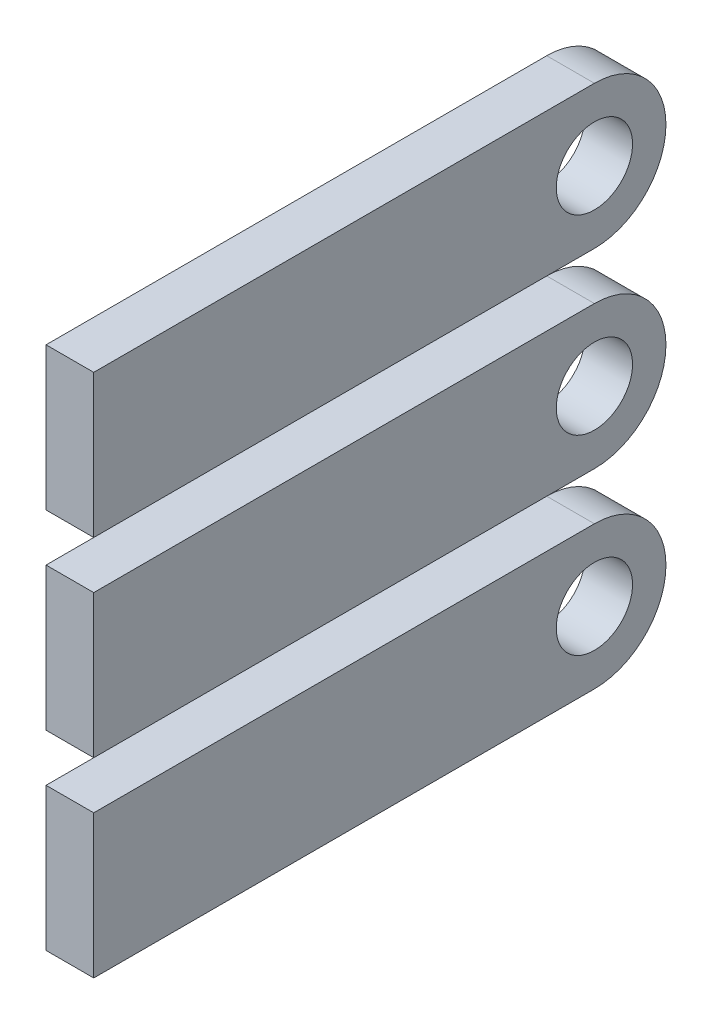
ISO-10303-21;
HEADER;
FILE_DESCRIPTION(('STEP AP214'),'2;1');
FILE_NAME('part.step','',(''),(''),'','','');
FILE_SCHEMA(('AUTOMOTIVE_DESIGN { 1 0 10303 214 1 1 1 1 }'));
ENDSEC;
DATA;
#1=APPLICATION_CONTEXT('core data for automotive mechanical design processes');
#2=APPLICATION_PROTOCOL_DEFINITION('international standard','automotive_design',2000,#1);
#3=PRODUCT_CONTEXT('',#1,'mechanical');
#4=PRODUCT('Part','Part','',(#3));
#5=PRODUCT_RELATED_PRODUCT_CATEGORY('part','',(#4));
#6=PRODUCT_DEFINITION_FORMATION('','',#4);
#7=PRODUCT_DEFINITION_CONTEXT('part definition',#1,'design');
#8=PRODUCT_DEFINITION('design','',#6,#7);
#9=PRODUCT_DEFINITION_SHAPE('','',#8);
#10=(LENGTH_UNIT() NAMED_UNIT(*) SI_UNIT(.MILLI.,.METRE.));
#11=(NAMED_UNIT(*) PLANE_ANGLE_UNIT() SI_UNIT($,.RADIAN.));
#12=(NAMED_UNIT(*) SI_UNIT($,.STERADIAN.) SOLID_ANGLE_UNIT());
#13=UNCERTAINTY_MEASURE_WITH_UNIT(LENGTH_MEASURE(1.E-05),#10,'distance_accuracy_value','');
#14=(GEOMETRIC_REPRESENTATION_CONTEXT(3) GLOBAL_UNCERTAINTY_ASSIGNED_CONTEXT((#13)) GLOBAL_UNIT_ASSIGNED_CONTEXT((#10,
#11,#12)) REPRESENTATION_CONTEXT('',''));
#15=CARTESIAN_POINT('',(0.,0.,0.));
#16=DIRECTION('',(0.,0.,1.));
#17=DIRECTION('',(1.,0.,0.));
#18=AXIS2_PLACEMENT_3D('',#15,#16,#17);
#19=CARTESIAN_POINT('',(63.2075,18.0108777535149,-52.4));
#20=DIRECTION('',(-1.,0.,0.));
#21=DIRECTION('',(0.,-1.,0.));
#22=AXIS2_PLACEMENT_3D('',#19,#20,#21);
#23=PLANE('',#22);
#24=CARTESIAN_POINT('',(63.2075,13.0983777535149,-47.4875));
#25=DIRECTION('',(-1.,0.,0.));
#26=DIRECTION('',(0.,-1.,0.));
#27=AXIS2_PLACEMENT_3D('',#24,#25,#26);
#28=CIRCLE('',#27,2.62);
#29=CARTESIAN_POINT('',(63.2075,10.4783777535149,-47.4875));
#30=VERTEX_POINT('',#29);
#31=EDGE_CURVE('E915',#30,#30,#28,.T.);
#32=ORIENTED_EDGE('',*,*,#31,.T.);
#33=EDGE_LOOP('',(#32));
#34=FACE_BOUND('',#33,.T.);
#35=DIRECTION('',(0.,0.,1.));
#36=VECTOR('',#35,1.);
#37=CARTESIAN_POINT('',(63.2075,8.18587775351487,-52.4));
#38=LINE('',#37,#36);
#39=CARTESIAN_POINT('',(63.2075,8.18587775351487,-47.4875));
#40=VERTEX_POINT('',#39);
#41=CARTESIAN_POINT('',(63.2075,8.18587775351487,-13.1));
#42=VERTEX_POINT('',#41);
#43=EDGE_CURVE('E902',#40,#42,#38,.T.);
#44=ORIENTED_EDGE('',*,*,#43,.F.);
#45=CARTESIAN_POINT('',(63.2075,13.0983777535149,-47.4875));
#46=DIRECTION('',(-1.,0.,0.));
#47=DIRECTION('',(0.,-1.,0.));
#48=AXIS2_PLACEMENT_3D('',#45,#46,#47);
#49=CIRCLE('',#48,4.9125);
#50=CARTESIAN_POINT('',(63.2075,18.0108777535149,-47.4875));
#51=VERTEX_POINT('',#50);
#52=EDGE_CURVE('E890',#51,#40,#49,.T.);
#53=ORIENTED_EDGE('',*,*,#52,.F.);
#54=DIRECTION('',(0.,0.,1.));
#55=VECTOR('',#54,1.);
#56=CARTESIAN_POINT('',(63.2075,18.0108777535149,-52.4));
#57=LINE('',#56,#55);
#58=CARTESIAN_POINT('',(63.2075,18.0108777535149,-13.1));
#59=VERTEX_POINT('',#58);
#60=EDGE_CURVE('E911',#51,#59,#57,.T.);
#61=ORIENTED_EDGE('',*,*,#60,.T.);
#62=DIRECTION('',(0.,-1.,0.));
#63=VECTOR('',#62,1.);
#64=CARTESIAN_POINT('',(63.2075,18.0108777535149,-13.1));
#65=LINE('',#64,#63);
#66=EDGE_CURVE('E880',#59,#42,#65,.T.);
#67=ORIENTED_EDGE('',*,*,#66,.T.);
#68=EDGE_LOOP('',(#44,#53,#61,#67));
#69=FACE_BOUND('',#68,.T.);
#70=ADVANCED_FACE('F845',(#34,#69),#23,.F.);
#71=CARTESIAN_POINT('',(59.9325,18.0108777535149,-52.4));
#72=DIRECTION('',(1.,0.,0.));
#73=DIRECTION('',(0.,0.,-1.));
#74=AXIS2_PLACEMENT_3D('',#71,#72,#73);
#75=PLANE('',#74);
#76=CARTESIAN_POINT('',(59.9325,13.0983777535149,-47.4875));
#77=DIRECTION('',(-1.,0.,0.));
#78=DIRECTION('',(0.,0.,1.));
#79=AXIS2_PLACEMENT_3D('',#76,#77,#78);
#80=CIRCLE('',#79,2.62);
#81=CARTESIAN_POINT('',(59.9325,13.0983777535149,-44.8675));
#82=VERTEX_POINT('',#81);
#83=EDGE_CURVE('E13',#82,#82,#80,.T.);
#84=ORIENTED_EDGE('',*,*,#83,.F.);
#85=EDGE_LOOP('',(#84));
#86=FACE_BOUND('',#85,.T.);
#87=CARTESIAN_POINT('',(59.9325,13.0983777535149,-47.4875));
#88=DIRECTION('',(-1.,0.,0.));
#89=DIRECTION('',(0.,0.,1.));
#90=AXIS2_PLACEMENT_3D('',#87,#88,#89);
#91=CIRCLE('',#90,4.9125);
#92=CARTESIAN_POINT('',(59.9325,18.0108777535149,-47.4875));
#93=VERTEX_POINT('',#92);
#94=CARTESIAN_POINT('',(59.9325,8.18587775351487,-47.4875));
#95=VERTEX_POINT('',#94);
#96=EDGE_CURVE('E905',#93,#95,#91,.T.);
#97=ORIENTED_EDGE('',*,*,#96,.T.);
#98=DIRECTION('',(0.,0.,1.));
#99=VECTOR('',#98,1.);
#100=CARTESIAN_POINT('',(59.9325,8.18587775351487,-52.4));
#101=LINE('',#100,#99);
#102=CARTESIAN_POINT('',(59.9325,8.18587775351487,-13.1));
#103=VERTEX_POINT('',#102);
#104=EDGE_CURVE('E901',#95,#103,#101,.T.);
#105=ORIENTED_EDGE('',*,*,#104,.T.);
#106=DIRECTION('',(0.,1.,0.));
#107=VECTOR('',#106,1.);
#108=CARTESIAN_POINT('',(59.9325,18.0108777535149,-13.1));
#109=LINE('',#108,#107);
#110=CARTESIAN_POINT('',(59.9325,18.0108777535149,-13.1));
#111=VERTEX_POINT('',#110);
#112=EDGE_CURVE('E886',#103,#111,#109,.T.);
#113=ORIENTED_EDGE('',*,*,#112,.T.);
#114=DIRECTION('',(0.,0.,1.));
#115=VECTOR('',#114,1.);
#116=CARTESIAN_POINT('',(59.9325,18.0108777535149,-52.4));
#117=LINE('',#116,#115);
#118=EDGE_CURVE('E891',#93,#111,#117,.T.);
#119=ORIENTED_EDGE('',*,*,#118,.F.);
#120=EDGE_LOOP('',(#97,#105,#113,#119));
#121=FACE_BOUND('',#120,.T.);
#122=ADVANCED_FACE('F899',(#86,#121),#75,.F.);
#123=CARTESIAN_POINT('',(63.2075,8.18587775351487,-52.4));
#124=DIRECTION('',(0.,1.,0.));
#125=DIRECTION('',(0.,0.,1.));
#126=AXIS2_PLACEMENT_3D('',#123,#124,#125);
#127=PLANE('',#126);
#128=DIRECTION('',(-1.,0.,0.));
#129=VECTOR('',#128,1.);
#130=CARTESIAN_POINT('',(112.3325,8.18587775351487,-47.4875));
#131=LINE('',#130,#129);
#132=EDGE_CURVE('E849',#40,#95,#131,.T.);
#133=ORIENTED_EDGE('',*,*,#132,.F.);
#134=ORIENTED_EDGE('',*,*,#43,.T.);
#135=DIRECTION('',(-1.,0.,0.));
#136=VECTOR('',#135,1.);
#137=CARTESIAN_POINT('',(63.2075,8.18587775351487,-13.1));
#138=LINE('',#137,#136);
#139=EDGE_CURVE('E862',#42,#103,#138,.T.);
#140=ORIENTED_EDGE('',*,*,#139,.T.);
#141=ORIENTED_EDGE('',*,*,#104,.F.);
#142=EDGE_LOOP('',(#133,#134,#140,#141));
#143=FACE_BOUND('',#142,.T.);
#144=ADVANCED_FACE('F927',(#143),#127,.F.);
#145=CARTESIAN_POINT('',(63.2075,18.0108777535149,-52.4));
#146=DIRECTION('',(0.,-1.,0.));
#147=DIRECTION('',(1.,0.,0.));
#148=AXIS2_PLACEMENT_3D('',#145,#146,#147);
#149=PLANE('',#148);
#150=ORIENTED_EDGE('',*,*,#60,.F.);
#151=DIRECTION('',(-1.,0.,0.));
#152=VECTOR('',#151,1.);
#153=CARTESIAN_POINT('',(112.3325,18.0108777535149,-47.4875));
#154=LINE('',#153,#152);
#155=EDGE_CURVE('E896',#51,#93,#154,.T.);
#156=ORIENTED_EDGE('',*,*,#155,.T.);
#157=ORIENTED_EDGE('',*,*,#118,.T.);
#158=DIRECTION('',(1.,0.,0.));
#159=VECTOR('',#158,1.);
#160=CARTESIAN_POINT('',(63.2075,18.0108777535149,-13.1));
#161=LINE('',#160,#159);
#162=EDGE_CURVE('E883',#111,#59,#161,.T.);
#163=ORIENTED_EDGE('',*,*,#162,.T.);
#164=EDGE_LOOP('',(#150,#156,#157,#163));
#165=FACE_BOUND('',#164,.T.);
#166=ADVANCED_FACE('F895',(#165),#149,.F.);
#167=CARTESIAN_POINT('',(112.3325,13.0983777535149,-47.4875));
#168=DIRECTION('',(-1.,0.,0.));
#169=DIRECTION('',(0.,0.,1.));
#170=AXIS2_PLACEMENT_3D('',#167,#168,#169);
#171=CYLINDRICAL_SURFACE('',#170,4.9125);
#172=ORIENTED_EDGE('',*,*,#52,.T.);
#173=ORIENTED_EDGE('',*,*,#132,.T.);
#174=ORIENTED_EDGE('',*,*,#96,.F.);
#175=ORIENTED_EDGE('',*,*,#155,.F.);
#176=EDGE_LOOP('',(#172,#173,#174,#175));
#177=FACE_BOUND('',#176,.T.);
#178=ADVANCED_FACE('F925',(#177),#171,.T.);
#179=CARTESIAN_POINT('',(112.3325,13.0983777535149,-47.4875));
#180=DIRECTION('',(-1.,0.,0.));
#181=DIRECTION('',(0.,0.,1.));
#182=AXIS2_PLACEMENT_3D('',#179,#180,#181);
#183=CYLINDRICAL_SURFACE('',#182,2.62);
#184=ORIENTED_EDGE('',*,*,#83,.T.);
#185=EDGE_LOOP('',(#184));
#186=FACE_BOUND('',#185,.T.);
#187=ORIENTED_EDGE('',*,*,#31,.F.);
#188=EDGE_LOOP('',(#187));
#189=FACE_BOUND('',#188,.T.);
#190=ADVANCED_FACE('F964',(#186,#189),#183,.F.);
#191=CARTESIAN_POINT('',(0.,0.,-13.1));
#192=DIRECTION('',(0.,0.,-1.));
#193=DIRECTION('',(-1.,0.,0.));
#194=AXIS2_PLACEMENT_3D('',#191,#192,#193);
#195=PLANE('',#194);
#196=ORIENTED_EDGE('',*,*,#66,.F.);
#197=ORIENTED_EDGE('',*,*,#162,.F.);
#198=ORIENTED_EDGE('',*,*,#112,.F.);
#199=ORIENTED_EDGE('',*,*,#139,.F.);
#200=EDGE_LOOP('',(#196,#197,#198,#199));
#201=FACE_BOUND('',#200,.T.);
#202=ADVANCED_FACE('F847',(#201),#195,.F.);
#203=CLOSED_SHELL('',(#70,#122,#144,#166,#178,#190,#202));
#204=MANIFOLD_SOLID_BREP('B2',#203);
#205=CARTESIAN_POINT('',(112.3325,-13.1016222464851,-47.4875));
#206=DIRECTION('',(-1.,0.,0.));
#207=DIRECTION('',(0.,0.,1.));
#208=AXIS2_PLACEMENT_3D('',#205,#206,#207);
#209=CYLINDRICAL_SURFACE('',#208,2.62);
#210=CARTESIAN_POINT('',(59.9325,-13.1016222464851,-47.4875));
#211=DIRECTION('',(-1.,0.,0.));
#212=DIRECTION('',(0.,0.,1.));
#213=AXIS2_PLACEMENT_3D('',#210,#211,#212);
#214=CIRCLE('',#213,2.62);
#215=CARTESIAN_POINT('',(59.9325,-13.1016222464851,-44.8675));
#216=VERTEX_POINT('',#215);
#217=EDGE_CURVE('E1069',#216,#216,#214,.T.);
#218=ORIENTED_EDGE('',*,*,#217,.T.);
#219=EDGE_LOOP('',(#218));
#220=FACE_BOUND('',#219,.T.);
#221=CARTESIAN_POINT('',(63.2075,-13.1016222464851,-47.4875));
#222=DIRECTION('',(-1.,0.,0.));
#223=DIRECTION('',(0.,-1.,0.));
#224=AXIS2_PLACEMENT_3D('',#221,#222,#223);
#225=CIRCLE('',#224,2.62);
#226=CARTESIAN_POINT('',(63.2075,-15.7216222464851,-47.4875));
#227=VERTEX_POINT('',#226);
#228=EDGE_CURVE('E1058',#227,#227,#225,.T.);
#229=ORIENTED_EDGE('',*,*,#228,.F.);
#230=EDGE_LOOP('',(#229));
#231=FACE_BOUND('',#230,.T.);
#232=ADVANCED_FACE('F1001',(#220,#231),#209,.F.);
#233=CARTESIAN_POINT('',(112.3325,-13.1016222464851,-47.4875));
#234=DIRECTION('',(-1.,0.,0.));
#235=DIRECTION('',(0.,0.,1.));
#236=AXIS2_PLACEMENT_3D('',#233,#234,#235);
#237=CYLINDRICAL_SURFACE('',#236,4.9125);
#238=CARTESIAN_POINT('',(63.2075,-13.1016222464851,-47.4875));
#239=DIRECTION('',(-1.,0.,0.));
#240=DIRECTION('',(0.,-1.,0.));
#241=AXIS2_PLACEMENT_3D('',#238,#239,#240);
#242=CIRCLE('',#241,4.9125);
#243=CARTESIAN_POINT('',(63.2075,-8.18912224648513,-47.4875));
#244=VERTEX_POINT('',#243);
#245=CARTESIAN_POINT('',(63.2075,-18.0141222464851,-47.4875));
#246=VERTEX_POINT('',#245);
#247=EDGE_CURVE('E1067',#244,#246,#242,.T.);
#248=ORIENTED_EDGE('',*,*,#247,.T.);
#249=DIRECTION('',(-1.,0.,0.));
#250=VECTOR('',#249,1.);
#251=CARTESIAN_POINT('',(112.3325,-18.0141222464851,-47.4875));
#252=LINE('',#251,#250);
#253=CARTESIAN_POINT('',(59.9325,-18.0141222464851,-47.4875));
#254=VERTEX_POINT('',#253);
#255=EDGE_CURVE('E1005',#246,#254,#252,.T.);
#256=ORIENTED_EDGE('',*,*,#255,.T.);
#257=CARTESIAN_POINT('',(59.9325,-13.1016222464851,-47.4875));
#258=DIRECTION('',(-1.,0.,0.));
#259=DIRECTION('',(0.,0.,1.));
#260=AXIS2_PLACEMENT_3D('',#257,#258,#259);
#261=CIRCLE('',#260,4.9125);
#262=CARTESIAN_POINT('',(59.9325,-8.18912224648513,-47.4875));
#263=VERTEX_POINT('',#262);
#264=EDGE_CURVE('E1062',#263,#254,#261,.T.);
#265=ORIENTED_EDGE('',*,*,#264,.F.);
#266=DIRECTION('',(-1.,0.,0.));
#267=VECTOR('',#266,1.);
#268=CARTESIAN_POINT('',(112.3325,-8.18912224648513,-47.4875));
#269=LINE('',#268,#267);
#270=EDGE_CURVE('E1052',#244,#263,#269,.T.);
#271=ORIENTED_EDGE('',*,*,#270,.F.);
#272=EDGE_LOOP('',(#248,#256,#265,#271));
#273=FACE_BOUND('',#272,.T.);
#274=ADVANCED_FACE('F1090',(#273),#237,.T.);
#275=CARTESIAN_POINT('',(63.2075,-8.18912224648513,-52.4));
#276=DIRECTION('',(0.,-1.,0.));
#277=DIRECTION('',(1.,0.,0.));
#278=AXIS2_PLACEMENT_3D('',#275,#276,#277);
#279=PLANE('',#278);
#280=DIRECTION('',(0.,0.,1.));
#281=VECTOR('',#280,1.);
#282=CARTESIAN_POINT('',(63.2075,-8.18912224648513,-52.4));
#283=LINE('',#282,#281);
#284=CARTESIAN_POINT('',(63.2075,-8.18912224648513,-13.1));
#285=VERTEX_POINT('',#284);
#286=EDGE_CURVE('E1011',#244,#285,#283,.T.);
#287=ORIENTED_EDGE('',*,*,#286,.F.);
#288=ORIENTED_EDGE('',*,*,#270,.T.);
#289=DIRECTION('',(0.,0.,1.));
#290=VECTOR('',#289,1.);
#291=CARTESIAN_POINT('',(59.9325,-8.18912224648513,-52.4));
#292=LINE('',#291,#290);
#293=CARTESIAN_POINT('',(59.9325,-8.18912224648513,-13.1));
#294=VERTEX_POINT('',#293);
#295=EDGE_CURVE('E1047',#263,#294,#292,.T.);
#296=ORIENTED_EDGE('',*,*,#295,.T.);
#297=DIRECTION('',(1.,0.,0.));
#298=VECTOR('',#297,1.);
#299=CARTESIAN_POINT('',(63.2075,-8.18912224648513,-13.1));
#300=LINE('',#299,#298);
#301=EDGE_CURVE('E1039',#294,#285,#300,.T.);
#302=ORIENTED_EDGE('',*,*,#301,.T.);
#303=EDGE_LOOP('',(#287,#288,#296,#302));
#304=FACE_BOUND('',#303,.T.);
#305=ADVANCED_FACE('F1051',(#304),#279,.F.);
#306=CARTESIAN_POINT('',(63.2075,-18.0141222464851,-52.4));
#307=DIRECTION('',(0.,1.,0.));
#308=DIRECTION('',(0.,0.,1.));
#309=AXIS2_PLACEMENT_3D('',#306,#307,#308);
#310=PLANE('',#309);
#311=ORIENTED_EDGE('',*,*,#255,.F.);
#312=DIRECTION('',(0.,0.,1.));
#313=VECTOR('',#312,1.);
#314=CARTESIAN_POINT('',(63.2075,-18.0141222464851,-52.4));
#315=LINE('',#314,#313);
#316=CARTESIAN_POINT('',(63.2075,-18.0141222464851,-13.1));
#317=VERTEX_POINT('',#316);
#318=EDGE_CURVE('E1046',#246,#317,#315,.T.);
#319=ORIENTED_EDGE('',*,*,#318,.T.);
#320=DIRECTION('',(-1.,0.,0.));
#321=VECTOR('',#320,1.);
#322=CARTESIAN_POINT('',(63.2075,-18.0141222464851,-13.1));
#323=LINE('',#322,#321);
#324=CARTESIAN_POINT('',(59.9325,-18.0141222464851,-13.1));
#325=VERTEX_POINT('',#324);
#326=EDGE_CURVE('E1020',#317,#325,#323,.T.);
#327=ORIENTED_EDGE('',*,*,#326,.T.);
#328=DIRECTION('',(0.,0.,1.));
#329=VECTOR('',#328,1.);
#330=CARTESIAN_POINT('',(59.9325,-18.0141222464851,-52.4));
#331=LINE('',#330,#329);
#332=EDGE_CURVE('E1057',#254,#325,#331,.T.);
#333=ORIENTED_EDGE('',*,*,#332,.F.);
#334=EDGE_LOOP('',(#311,#319,#327,#333));
#335=FACE_BOUND('',#334,.T.);
#336=ADVANCED_FACE('F1078',(#335),#310,.F.);
#337=CARTESIAN_POINT('',(59.9325,-8.18912224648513,-52.4));
#338=DIRECTION('',(1.,0.,0.));
#339=DIRECTION('',(0.,0.,-1.));
#340=AXIS2_PLACEMENT_3D('',#337,#338,#339);
#341=PLANE('',#340);
#342=ORIENTED_EDGE('',*,*,#217,.F.);
#343=EDGE_LOOP('',(#342));
#344=FACE_BOUND('',#343,.T.);
#345=ORIENTED_EDGE('',*,*,#264,.T.);
#346=ORIENTED_EDGE('',*,*,#332,.T.);
#347=DIRECTION('',(0.,1.,0.));
#348=VECTOR('',#347,1.);
#349=CARTESIAN_POINT('',(59.9325,-8.18912224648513,-13.1));
#350=LINE('',#349,#348);
#351=EDGE_CURVE('E1042',#325,#294,#350,.T.);
#352=ORIENTED_EDGE('',*,*,#351,.T.);
#353=ORIENTED_EDGE('',*,*,#295,.F.);
#354=EDGE_LOOP('',(#345,#346,#352,#353));
#355=FACE_BOUND('',#354,.T.);
#356=ADVANCED_FACE('F1055',(#344,#355),#341,.F.);
#357=CARTESIAN_POINT('',(63.2075,-8.18912224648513,-52.4));
#358=DIRECTION('',(-1.,0.,0.));
#359=DIRECTION('',(0.,-1.,0.));
#360=AXIS2_PLACEMENT_3D('',#357,#358,#359);
#361=PLANE('',#360);
#362=ORIENTED_EDGE('',*,*,#228,.T.);
#363=EDGE_LOOP('',(#362));
#364=FACE_BOUND('',#363,.T.);
#365=ORIENTED_EDGE('',*,*,#318,.F.);
#366=ORIENTED_EDGE('',*,*,#247,.F.);
#367=ORIENTED_EDGE('',*,*,#286,.T.);
#368=DIRECTION('',(0.,-1.,0.));
#369=VECTOR('',#368,1.);
#370=CARTESIAN_POINT('',(63.2075,-8.18912224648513,-13.1));
#371=LINE('',#370,#369);
#372=EDGE_CURVE('E843',#285,#317,#371,.T.);
#373=ORIENTED_EDGE('',*,*,#372,.T.);
#374=EDGE_LOOP('',(#365,#366,#367,#373));
#375=FACE_BOUND('',#374,.T.);
#376=ADVANCED_FACE('F1077',(#364,#375),#361,.F.);
#377=CARTESIAN_POINT('',(0.,0.,-13.1));
#378=DIRECTION('',(0.,0.,-1.));
#379=DIRECTION('',(-1.,0.,0.));
#380=AXIS2_PLACEMENT_3D('',#377,#378,#379);
#381=PLANE('',#380);
#382=ORIENTED_EDGE('',*,*,#372,.F.);
#383=ORIENTED_EDGE('',*,*,#301,.F.);
#384=ORIENTED_EDGE('',*,*,#351,.F.);
#385=ORIENTED_EDGE('',*,*,#326,.F.);
#386=EDGE_LOOP('',(#382,#383,#384,#385));
#387=FACE_BOUND('',#386,.T.);
#388=ADVANCED_FACE('F1003',(#387),#381,.F.);
#389=CLOSED_SHELL('',(#232,#274,#305,#336,#356,#376,#388));
#390=MANIFOLD_SOLID_BREP('B7',#389);
#391=CARTESIAN_POINT('',(112.3325,-0.00162224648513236,-47.4875));
#392=DIRECTION('',(-1.,0.,0.));
#393=DIRECTION('',(0.,0.,1.));
#394=AXIS2_PLACEMENT_3D('',#391,#392,#393);
#395=CYLINDRICAL_SURFACE('',#394,2.62);
#396=CARTESIAN_POINT('',(59.9325,-0.00162224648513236,-47.4875));
#397=DIRECTION('',(-1.,0.,0.));
#398=DIRECTION('',(0.,0.,1.));
#399=AXIS2_PLACEMENT_3D('',#396,#397,#398);
#400=CIRCLE('',#399,2.62);
#401=CARTESIAN_POINT('',(59.9325,-0.00162224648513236,-44.8675));
#402=VERTEX_POINT('',#401);
#403=EDGE_CURVE('E1223',#402,#402,#400,.T.);
#404=ORIENTED_EDGE('',*,*,#403,.T.);
#405=EDGE_LOOP('',(#404));
#406=FACE_BOUND('',#405,.T.);
#407=CARTESIAN_POINT('',(63.2075,-0.00162224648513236,-47.4875));
#408=DIRECTION('',(-1.,0.,0.));
#409=DIRECTION('',(0.,-1.,0.));
#410=AXIS2_PLACEMENT_3D('',#407,#408,#409);
#411=CIRCLE('',#410,2.62);
#412=CARTESIAN_POINT('',(63.2075,-2.62162224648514,-47.4875));
#413=VERTEX_POINT('',#412);
#414=EDGE_CURVE('E1220',#413,#413,#411,.T.);
#415=ORIENTED_EDGE('',*,*,#414,.F.);
#416=EDGE_LOOP('',(#415));
#417=FACE_BOUND('',#416,.T.);
#418=ADVANCED_FACE('F1148',(#406,#417),#395,.F.);
#419=CARTESIAN_POINT('',(112.3325,-0.00162224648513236,-47.4875));
#420=DIRECTION('',(-1.,0.,0.));
#421=DIRECTION('',(0.,0.,1.));
#422=AXIS2_PLACEMENT_3D('',#419,#420,#421);
#423=CYLINDRICAL_SURFACE('',#422,4.9125);
#424=CARTESIAN_POINT('',(63.2075,-0.00162224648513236,-47.4875));
#425=DIRECTION('',(-1.,0.,0.));
#426=DIRECTION('',(0.,-1.,0.));
#427=AXIS2_PLACEMENT_3D('',#424,#425,#426);
#428=CIRCLE('',#427,4.9125);
#429=CARTESIAN_POINT('',(63.2075,4.91087775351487,-47.4875));
#430=VERTEX_POINT('',#429);
#431=CARTESIAN_POINT('',(63.2075,-4.91412224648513,-47.4875));
#432=VERTEX_POINT('',#431);
#433=EDGE_CURVE('E1212',#430,#432,#428,.T.);
#434=ORIENTED_EDGE('',*,*,#433,.T.);
#435=DIRECTION('',(-1.,0.,0.));
#436=VECTOR('',#435,1.);
#437=CARTESIAN_POINT('',(112.3325,-4.91412224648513,-47.4875));
#438=LINE('',#437,#436);
#439=CARTESIAN_POINT('',(59.9325,-4.91412224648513,-47.4875));
#440=VERTEX_POINT('',#439);
#441=EDGE_CURVE('E1226',#432,#440,#438,.T.);
#442=ORIENTED_EDGE('',*,*,#441,.T.);
#443=CARTESIAN_POINT('',(59.9325,-0.00162224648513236,-47.4875));
#444=DIRECTION('',(-1.,0.,0.));
#445=DIRECTION('',(0.,0.,1.));
#446=AXIS2_PLACEMENT_3D('',#443,#444,#445);
#447=CIRCLE('',#446,4.9125);
#448=CARTESIAN_POINT('',(59.9325,4.91087775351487,-47.4875));
#449=VERTEX_POINT('',#448);
#450=EDGE_CURVE('E1216',#449,#440,#447,.T.);
#451=ORIENTED_EDGE('',*,*,#450,.F.);
#452=DIRECTION('',(-1.,0.,0.));
#453=VECTOR('',#452,1.);
#454=CARTESIAN_POINT('',(112.3325,4.91087775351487,-47.4875));
#455=LINE('',#454,#453);
#456=EDGE_CURVE('E1171',#430,#449,#455,.T.);
#457=ORIENTED_EDGE('',*,*,#456,.F.);
#458=EDGE_LOOP('',(#434,#442,#451,#457));
#459=FACE_BOUND('',#458,.T.);
#460=ADVANCED_FACE('F1227',(#459),#423,.T.);
#461=CARTESIAN_POINT('',(63.2075,4.91087775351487,-52.4));
#462=DIRECTION('',(0.,-1.,0.));
#463=DIRECTION('',(1.,0.,0.));
#464=AXIS2_PLACEMENT_3D('',#461,#462,#463);
#465=PLANE('',#464);
#466=DIRECTION('',(0.,0.,1.));
#467=VECTOR('',#466,1.);
#468=CARTESIAN_POINT('',(63.2075,4.91087775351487,-52.4));
#469=LINE('',#468,#467);
#470=CARTESIAN_POINT('',(63.2075,4.91087775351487,-13.1));
#471=VERTEX_POINT('',#470);
#472=EDGE_CURVE('E1195',#430,#471,#469,.T.);
#473=ORIENTED_EDGE('',*,*,#472,.F.);
#474=ORIENTED_EDGE('',*,*,#456,.T.);
#475=DIRECTION('',(0.,0.,1.));
#476=VECTOR('',#475,1.);
#477=CARTESIAN_POINT('',(59.9325,4.91087775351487,-52.4));
#478=LINE('',#477,#476);
#479=CARTESIAN_POINT('',(59.9325,4.91087775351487,-13.1));
#480=VERTEX_POINT('',#479);
#481=EDGE_CURVE('E1198',#449,#480,#478,.T.);
#482=ORIENTED_EDGE('',*,*,#481,.T.);
#483=DIRECTION('',(1.,0.,0.));
#484=VECTOR('',#483,1.);
#485=CARTESIAN_POINT('',(63.2075,4.91087775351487,-13.1));
#486=LINE('',#485,#484);
#487=EDGE_CURVE('E1187',#480,#471,#486,.T.);
#488=ORIENTED_EDGE('',*,*,#487,.T.);
#489=EDGE_LOOP('',(#473,#474,#482,#488));
#490=FACE_BOUND('',#489,.T.);
#491=ADVANCED_FACE('F1199',(#490),#465,.F.);
#492=CARTESIAN_POINT('',(63.2075,-4.91412224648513,-52.4));
#493=DIRECTION('',(0.,1.,0.));
#494=DIRECTION('',(0.,0.,1.));
#495=AXIS2_PLACEMENT_3D('',#492,#493,#494);
#496=PLANE('',#495);
#497=ORIENTED_EDGE('',*,*,#441,.F.);
#498=DIRECTION('',(0.,0.,1.));
#499=VECTOR('',#498,1.);
#500=CARTESIAN_POINT('',(63.2075,-4.91412224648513,-52.4));
#501=LINE('',#500,#499);
#502=CARTESIAN_POINT('',(63.2075,-4.91412224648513,-13.1));
#503=VERTEX_POINT('',#502);
#504=EDGE_CURVE('E999',#432,#503,#501,.T.);
#505=ORIENTED_EDGE('',*,*,#504,.T.);
#506=DIRECTION('',(-1.,0.,0.));
#507=VECTOR('',#506,1.);
#508=CARTESIAN_POINT('',(63.2075,-4.91412224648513,-13.1));
#509=LINE('',#508,#507);
#510=CARTESIAN_POINT('',(59.9325,-4.91412224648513,-13.1));
#511=VERTEX_POINT('',#510);
#512=EDGE_CURVE('E1205',#503,#511,#509,.T.);
#513=ORIENTED_EDGE('',*,*,#512,.T.);
#514=DIRECTION('',(0.,0.,1.));
#515=VECTOR('',#514,1.);
#516=CARTESIAN_POINT('',(59.9325,-4.91412224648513,-52.4));
#517=LINE('',#516,#515);
#518=EDGE_CURVE('E1156',#440,#511,#517,.T.);
#519=ORIENTED_EDGE('',*,*,#518,.F.);
#520=EDGE_LOOP('',(#497,#505,#513,#519));
#521=FACE_BOUND('',#520,.T.);
#522=ADVANCED_FACE('F1229',(#521),#496,.F.);
#523=CARTESIAN_POINT('',(59.9325,4.91087775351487,-52.4));
#524=DIRECTION('',(1.,0.,0.));
#525=DIRECTION('',(0.,0.,-1.));
#526=AXIS2_PLACEMENT_3D('',#523,#524,#525);
#527=PLANE('',#526);
#528=ORIENTED_EDGE('',*,*,#403,.F.);
#529=EDGE_LOOP('',(#528));
#530=FACE_BOUND('',#529,.T.);
#531=ORIENTED_EDGE('',*,*,#450,.T.);
#532=ORIENTED_EDGE('',*,*,#518,.T.);
#533=DIRECTION('',(0.,1.,0.));
#534=VECTOR('',#533,1.);
#535=CARTESIAN_POINT('',(59.9325,4.91087775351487,-13.1));
#536=LINE('',#535,#534);
#537=EDGE_CURVE('E1191',#511,#480,#536,.T.);
#538=ORIENTED_EDGE('',*,*,#537,.T.);
#539=ORIENTED_EDGE('',*,*,#481,.F.);
#540=EDGE_LOOP('',(#531,#532,#538,#539));
#541=FACE_BOUND('',#540,.T.);
#542=ADVANCED_FACE('F1202',(#530,#541),#527,.F.);
#543=CARTESIAN_POINT('',(63.2075,4.91087775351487,-52.4));
#544=DIRECTION('',(-1.,0.,0.));
#545=DIRECTION('',(0.,-1.,0.));
#546=AXIS2_PLACEMENT_3D('',#543,#544,#545);
#547=PLANE('',#546);
#548=ORIENTED_EDGE('',*,*,#414,.T.);
#549=EDGE_LOOP('',(#548));
#550=FACE_BOUND('',#549,.T.);
#551=ORIENTED_EDGE('',*,*,#504,.F.);
#552=ORIENTED_EDGE('',*,*,#433,.F.);
#553=ORIENTED_EDGE('',*,*,#472,.T.);
#554=DIRECTION('',(0.,-1.,0.));
#555=VECTOR('',#554,1.);
#556=CARTESIAN_POINT('',(63.2075,4.91087775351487,-13.1));
#557=LINE('',#556,#555);
#558=EDGE_CURVE('E1163',#471,#503,#557,.T.);
#559=ORIENTED_EDGE('',*,*,#558,.T.);
#560=EDGE_LOOP('',(#551,#552,#553,#559));
#561=FACE_BOUND('',#560,.T.);
#562=ADVANCED_FACE('F1150',(#550,#561),#547,.F.);
#563=CARTESIAN_POINT('',(0.,0.,-13.1));
#564=DIRECTION('',(0.,0.,-1.));
#565=DIRECTION('',(-1.,0.,0.));
#566=AXIS2_PLACEMENT_3D('',#563,#564,#565);
#567=PLANE('',#566);
#568=ORIENTED_EDGE('',*,*,#558,.F.);
#569=ORIENTED_EDGE('',*,*,#487,.F.);
#570=ORIENTED_EDGE('',*,*,#537,.F.);
#571=ORIENTED_EDGE('',*,*,#512,.F.);
#572=EDGE_LOOP('',(#568,#569,#570,#571));
#573=FACE_BOUND('',#572,.T.);
#574=ADVANCED_FACE('F1189',(#573),#567,.F.);
#575=CLOSED_SHELL('',(#418,#460,#491,#522,#542,#562,#574));
#576=MANIFOLD_SOLID_BREP('B837',#575);
#577=ADVANCED_BREP_SHAPE_REPRESENTATION('',(#18,#204,#390,#576),#14);
#578=SHAPE_DEFINITION_REPRESENTATION(#9,#577);
ENDSEC;
END-ISO-10303-21;
